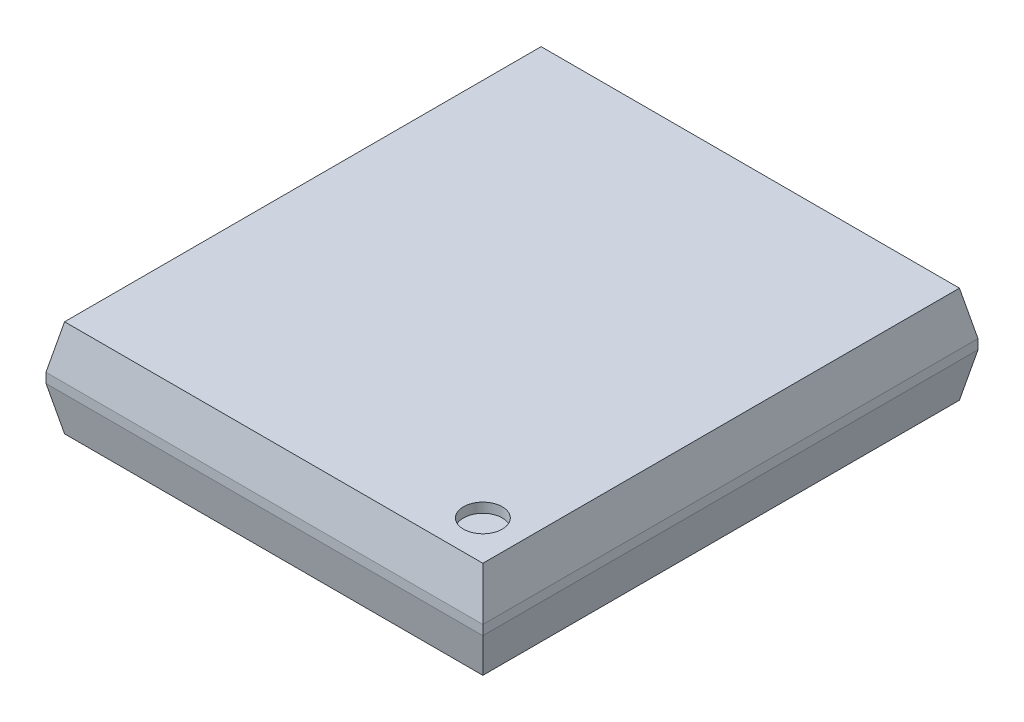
ISO-10303-21;
HEADER;
FILE_DESCRIPTION(('STEP AP214'),'2;1');
FILE_NAME('part.step','',(''),(''),'','','');
FILE_SCHEMA(('AUTOMOTIVE_DESIGN { 1 0 10303 214 1 1 1 1 }'));
ENDSEC;
DATA;
#1=APPLICATION_CONTEXT('core data for automotive mechanical design processes');
#2=APPLICATION_PROTOCOL_DEFINITION('international standard','automotive_design',2000,#1);
#3=PRODUCT_CONTEXT('',#1,'mechanical');
#4=PRODUCT('Part','Part','',(#3));
#5=PRODUCT_RELATED_PRODUCT_CATEGORY('part','',(#4));
#6=PRODUCT_DEFINITION_FORMATION('','',#4);
#7=PRODUCT_DEFINITION_CONTEXT('part definition',#1,'design');
#8=PRODUCT_DEFINITION('design','',#6,#7);
#9=PRODUCT_DEFINITION_SHAPE('','',#8);
#10=(LENGTH_UNIT() NAMED_UNIT(*) SI_UNIT(.MILLI.,.METRE.));
#11=(NAMED_UNIT(*) PLANE_ANGLE_UNIT() SI_UNIT($,.RADIAN.));
#12=(NAMED_UNIT(*) SI_UNIT($,.STERADIAN.) SOLID_ANGLE_UNIT());
#13=UNCERTAINTY_MEASURE_WITH_UNIT(LENGTH_MEASURE(1.E-05),#10,'distance_accuracy_value','');
#14=(GEOMETRIC_REPRESENTATION_CONTEXT(3) GLOBAL_UNCERTAINTY_ASSIGNED_CONTEXT((#13)) GLOBAL_UNIT_ASSIGNED_CONTEXT((#10,
#11,#12)) REPRESENTATION_CONTEXT('',''));
#15=CARTESIAN_POINT('',(0.,0.,0.));
#16=DIRECTION('',(0.,0.,1.));
#17=DIRECTION('',(1.,0.,0.));
#18=AXIS2_PLACEMENT_3D('',#15,#16,#17);
#19=CARTESIAN_POINT('',(1.75,0.4,2.05));
#20=DIRECTION('',(0.,1.,0.));
#21=DIRECTION('',(0.,0.,1.));
#22=AXIS2_PLACEMENT_3D('',#19,#20,#21);
#23=PLANE('',#22);
#24=CARTESIAN_POINT('',(1.75,0.4,2.05));
#25=DIRECTION('',(0.,1.,0.));
#26=DIRECTION('',(0.,0.,1.));
#27=AXIS2_PLACEMENT_3D('',#24,#25,#26);
#28=CIRCLE('',#27,0.200000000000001);
#29=CARTESIAN_POINT('',(1.75,0.4,2.25));
#30=VERTEX_POINT('',#29);
#31=EDGE_CURVE('E20',#30,#30,#28,.T.);
#32=ORIENTED_EDGE('',*,*,#31,.T.);
#33=EDGE_LOOP('',(#32));
#34=FACE_BOUND('',#33,.T.);
#35=ADVANCED_FACE('F17',(#34),#23,.T.);
#36=CARTESIAN_POINT('',(1.75,0.4,2.05));
#37=DIRECTION('',(0.,1.,0.));
#38=DIRECTION('',(0.,0.,1.));
#39=AXIS2_PLACEMENT_3D('',#36,#37,#38);
#40=CYLINDRICAL_SURFACE('',#39,0.200000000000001);
#41=CARTESIAN_POINT('',(1.75,0.5,2.05));
#42=DIRECTION('',(0.,1.,0.));
#43=DIRECTION('',(0.,0.,1.));
#44=AXIS2_PLACEMENT_3D('',#41,#42,#43);
#45=CIRCLE('',#44,0.200000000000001);
#46=CARTESIAN_POINT('',(1.75,0.5,2.25));
#47=VERTEX_POINT('',#46);
#48=EDGE_CURVE('E96',#47,#47,#45,.F.);
#49=ORIENTED_EDGE('',*,*,#48,.F.);
#50=EDGE_LOOP('',(#49));
#51=FACE_BOUND('',#50,.T.);
#52=ORIENTED_EDGE('',*,*,#31,.F.);
#53=EDGE_LOOP('',(#52));
#54=FACE_BOUND('',#53,.T.);
#55=ADVANCED_FACE('F115',(#51,#54),#40,.F.);
#56=CARTESIAN_POINT('',(-2.25,0.5,2.55));
#57=DIRECTION('',(0.,1.,0.));
#58=DIRECTION('',(0.,0.,1.));
#59=AXIS2_PLACEMENT_3D('',#56,#57,#58);
#60=PLANE('',#59);
#61=DIRECTION('',(1.,0.,0.));
#62=VECTOR('',#61,1.);
#63=CARTESIAN_POINT('',(-2.25,0.5,2.45434954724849));
#64=LINE('',#63,#62);
#65=CARTESIAN_POINT('',(-2.15434954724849,0.5,2.45434954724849));
#66=VERTEX_POINT('',#65);
#67=CARTESIAN_POINT('',(2.15434954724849,0.5,2.45434954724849));
#68=VERTEX_POINT('',#67);
#69=EDGE_CURVE('E88',#66,#68,#64,.T.);
#70=ORIENTED_EDGE('',*,*,#69,.T.);
#71=DIRECTION('',(0.,0.,1.));
#72=VECTOR('',#71,1.);
#73=CARTESIAN_POINT('',(2.15434954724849,0.5,2.55));
#74=LINE('',#73,#72);
#75=CARTESIAN_POINT('',(2.15434954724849,0.5,-2.45434954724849));
#76=VERTEX_POINT('',#75);
#77=EDGE_CURVE('E79',#68,#76,#74,.F.);
#78=ORIENTED_EDGE('',*,*,#77,.T.);
#79=DIRECTION('',(1.,0.,0.));
#80=VECTOR('',#79,1.);
#81=CARTESIAN_POINT('',(-2.25,0.5,-2.45434954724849));
#82=LINE('',#81,#80);
#83=CARTESIAN_POINT('',(-2.15434954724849,0.5,-2.45434954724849));
#84=VERTEX_POINT('',#83);
#85=EDGE_CURVE('E90',#76,#84,#82,.F.);
#86=ORIENTED_EDGE('',*,*,#85,.T.);
#87=DIRECTION('',(0.,0.,1.));
#88=VECTOR('',#87,1.);
#89=CARTESIAN_POINT('',(-2.15434954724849,0.5,2.55));
#90=LINE('',#89,#88);
#91=EDGE_CURVE('E84',#84,#66,#90,.T.);
#92=ORIENTED_EDGE('',*,*,#91,.T.);
#93=EDGE_LOOP('',(#70,#78,#86,#92));
#94=FACE_BOUND('',#93,.T.);
#95=ORIENTED_EDGE('',*,*,#48,.T.);
#96=EDGE_LOOP('',(#95));
#97=FACE_BOUND('',#96,.T.);
#98=ADVANCED_FACE('F86',(#94,#97),#60,.T.);
#99=CARTESIAN_POINT('',(-2.15434954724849,0.5,2.55));
#100=DIRECTION('',(0.978147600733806,-0.207911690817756,0.));
#101=DIRECTION('',(0.207911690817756,0.978147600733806,0.));
#102=AXIS2_PLACEMENT_3D('',#99,#100,#101);
#103=PLANE('',#102);
#104=DIRECTION('',(0.,0.,1.));
#105=VECTOR('',#104,1.);
#106=CARTESIAN_POINT('',(-2.25,0.0499999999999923,-2.55));
#107=LINE('',#106,#105);
#108=CARTESIAN_POINT('',(-2.25,0.0499999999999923,2.55));
#109=VERTEX_POINT('',#108);
#110=CARTESIAN_POINT('',(-2.25,0.0499999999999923,-2.55));
#111=VERTEX_POINT('',#110);
#112=EDGE_CURVE('E105',#109,#111,#107,.F.);
#113=ORIENTED_EDGE('',*,*,#112,.F.);
#114=DIRECTION('',(0.203558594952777,0.957667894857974,-0.203558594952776));
#115=VECTOR('',#114,1.);
#116=CARTESIAN_POINT('',(-2.25,0.0499999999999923,2.55));
#117=LINE('',#116,#115);
#118=EDGE_CURVE('E95',#109,#66,#117,.T.);
#119=ORIENTED_EDGE('',*,*,#118,.T.);
#120=ORIENTED_EDGE('',*,*,#91,.F.);
#121=DIRECTION('',(-0.203558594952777,-0.957667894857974,-0.203558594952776));
#122=VECTOR('',#121,1.);
#123=CARTESIAN_POINT('',(-2.15434954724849,0.5,-2.45434954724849));
#124=LINE('',#123,#122);
#125=EDGE_CURVE('E340',#84,#111,#124,.T.);
#126=ORIENTED_EDGE('',*,*,#125,.T.);
#127=EDGE_LOOP('',(#113,#119,#120,#126));
#128=FACE_BOUND('',#127,.T.);
#129=ADVANCED_FACE('F104',(#128),#103,.F.);
#130=CARTESIAN_POINT('',(-2.25,0.5,2.45434954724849));
#131=DIRECTION('',(0.,-0.207911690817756,-0.978147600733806));
#132=DIRECTION('',(0.,0.978147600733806,-0.207911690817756));
#133=AXIS2_PLACEMENT_3D('',#130,#131,#132);
#134=PLANE('',#133);
#135=ORIENTED_EDGE('',*,*,#69,.F.);
#136=ORIENTED_EDGE('',*,*,#118,.F.);
#137=DIRECTION('',(1.,0.,0.));
#138=VECTOR('',#137,1.);
#139=CARTESIAN_POINT('',(-2.25,0.0499999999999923,2.55));
#140=LINE('',#139,#138);
#141=CARTESIAN_POINT('',(2.25,0.0499999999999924,2.55));
#142=VERTEX_POINT('',#141);
#143=EDGE_CURVE('E334',#142,#109,#140,.F.);
#144=ORIENTED_EDGE('',*,*,#143,.F.);
#145=DIRECTION('',(-0.203558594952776,0.957667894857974,-0.203558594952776));
#146=VECTOR('',#145,1.);
#147=CARTESIAN_POINT('',(2.25,0.0499999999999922,2.55));
#148=LINE('',#147,#146);
#149=EDGE_CURVE('E102',#142,#68,#148,.T.);
#150=ORIENTED_EDGE('',*,*,#149,.T.);
#151=EDGE_LOOP('',(#135,#136,#144,#150));
#152=FACE_BOUND('',#151,.T.);
#153=ADVANCED_FACE('F99',(#152),#134,.F.);
#154=CARTESIAN_POINT('',(2.15434954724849,0.5,2.55));
#155=DIRECTION('',(-0.978147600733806,-0.207911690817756,0.));
#156=DIRECTION('',(0.207911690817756,-0.978147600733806,0.));
#157=AXIS2_PLACEMENT_3D('',#154,#155,#156);
#158=PLANE('',#157);
#159=DIRECTION('',(0.,0.,-1.));
#160=VECTOR('',#159,1.);
#161=CARTESIAN_POINT('',(2.25,0.0499999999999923,-2.55));
#162=LINE('',#161,#160);
#163=CARTESIAN_POINT('',(2.25,0.0499999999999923,-2.55));
#164=VERTEX_POINT('',#163);
#165=EDGE_CURVE('E311',#164,#142,#162,.F.);
#166=ORIENTED_EDGE('',*,*,#165,.F.);
#167=DIRECTION('',(-0.203558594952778,0.957667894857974,0.203558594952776));
#168=VECTOR('',#167,1.);
#169=CARTESIAN_POINT('',(2.25,0.0499999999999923,-2.55));
#170=LINE('',#169,#168);
#171=EDGE_CURVE('E313',#164,#76,#170,.T.);
#172=ORIENTED_EDGE('',*,*,#171,.T.);
#173=ORIENTED_EDGE('',*,*,#77,.F.);
#174=ORIENTED_EDGE('',*,*,#149,.F.);
#175=EDGE_LOOP('',(#166,#172,#173,#174));
#176=FACE_BOUND('',#175,.T.);
#177=ADVANCED_FACE('F166',(#176),#158,.F.);
#178=CARTESIAN_POINT('',(-2.25,0.5,-2.45434954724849));
#179=DIRECTION('',(0.,-0.207911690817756,0.978147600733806));
#180=DIRECTION('',(0.,-0.978147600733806,-0.207911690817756));
#181=AXIS2_PLACEMENT_3D('',#178,#179,#180);
#182=PLANE('',#181);
#183=DIRECTION('',(-1.,0.,0.));
#184=VECTOR('',#183,1.);
#185=CARTESIAN_POINT('',(-2.25,0.0499999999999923,-2.55));
#186=LINE('',#185,#184);
#187=EDGE_CURVE('E321',#111,#164,#186,.F.);
#188=ORIENTED_EDGE('',*,*,#187,.F.);
#189=ORIENTED_EDGE('',*,*,#125,.F.);
#190=ORIENTED_EDGE('',*,*,#85,.F.);
#191=ORIENTED_EDGE('',*,*,#171,.F.);
#192=EDGE_LOOP('',(#188,#189,#190,#191));
#193=FACE_BOUND('',#192,.T.);
#194=ADVANCED_FACE('F162',(#193),#182,.F.);
#195=CARTESIAN_POINT('',(-2.25,-0.5,-2.55));
#196=DIRECTION('',(-1.,0.,0.));
#197=DIRECTION('',(0.,0.,1.));
#198=AXIS2_PLACEMENT_3D('',#195,#196,#197);
#199=PLANE('',#198);
#200=DIRECTION('',(0.,1.,0.));
#201=VECTOR('',#200,1.);
#202=CARTESIAN_POINT('',(-2.25,-0.5,2.55));
#203=LINE('',#202,#201);
#204=CARTESIAN_POINT('',(-2.25,-0.0499999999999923,2.55));
#205=VERTEX_POINT('',#204);
#206=EDGE_CURVE('E336',#109,#205,#203,.F.);
#207=ORIENTED_EDGE('',*,*,#206,.F.);
#208=ORIENTED_EDGE('',*,*,#112,.T.);
#209=DIRECTION('',(0.,1.,0.));
#210=VECTOR('',#209,1.);
#211=CARTESIAN_POINT('',(-2.25,-0.5,-2.55));
#212=LINE('',#211,#210);
#213=CARTESIAN_POINT('',(-2.25,-0.0499999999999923,-2.55));
#214=VERTEX_POINT('',#213);
#215=EDGE_CURVE('E324',#214,#111,#212,.T.);
#216=ORIENTED_EDGE('',*,*,#215,.F.);
#217=DIRECTION('',(0.,0.,1.));
#218=VECTOR('',#217,1.);
#219=CARTESIAN_POINT('',(-2.25,-0.0499999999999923,-2.55));
#220=LINE('',#219,#218);
#221=EDGE_CURVE('E325',#205,#214,#220,.F.);
#222=ORIENTED_EDGE('',*,*,#221,.F.);
#223=EDGE_LOOP('',(#207,#208,#216,#222));
#224=FACE_BOUND('',#223,.T.);
#225=ADVANCED_FACE('F158',(#224),#199,.T.);
#226=CARTESIAN_POINT('',(-2.25,-0.5,2.55));
#227=DIRECTION('',(0.,0.,1.));
#228=DIRECTION('',(1.,0.,0.));
#229=AXIS2_PLACEMENT_3D('',#226,#227,#228);
#230=PLANE('',#229);
#231=DIRECTION('',(0.,1.,0.));
#232=VECTOR('',#231,1.);
#233=CARTESIAN_POINT('',(2.25,-0.5,2.55));
#234=LINE('',#233,#232);
#235=CARTESIAN_POINT('',(2.25,-0.0499999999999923,2.55));
#236=VERTEX_POINT('',#235);
#237=EDGE_CURVE('E317',#142,#236,#234,.F.);
#238=ORIENTED_EDGE('',*,*,#237,.F.);
#239=ORIENTED_EDGE('',*,*,#143,.T.);
#240=ORIENTED_EDGE('',*,*,#206,.T.);
#241=DIRECTION('',(1.,0.,0.));
#242=VECTOR('',#241,1.);
#243=CARTESIAN_POINT('',(-2.25,-0.0499999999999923,2.55));
#244=LINE('',#243,#242);
#245=EDGE_CURVE('E347',#236,#205,#244,.F.);
#246=ORIENTED_EDGE('',*,*,#245,.F.);
#247=EDGE_LOOP('',(#238,#239,#240,#246));
#248=FACE_BOUND('',#247,.T.);
#249=ADVANCED_FACE('F154',(#248),#230,.T.);
#250=CARTESIAN_POINT('',(2.25,-0.5,-2.55));
#251=DIRECTION('',(1.,0.,0.));
#252=DIRECTION('',(0.,0.,-1.));
#253=AXIS2_PLACEMENT_3D('',#250,#251,#252);
#254=PLANE('',#253);
#255=DIRECTION('',(0.,1.,0.));
#256=VECTOR('',#255,1.);
#257=CARTESIAN_POINT('',(2.25,-0.5,-2.55));
#258=LINE('',#257,#256);
#259=CARTESIAN_POINT('',(2.25,-0.0499999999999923,-2.55));
#260=VERTEX_POINT('',#259);
#261=EDGE_CURVE('E316',#164,#260,#258,.F.);
#262=ORIENTED_EDGE('',*,*,#261,.F.);
#263=ORIENTED_EDGE('',*,*,#165,.T.);
#264=ORIENTED_EDGE('',*,*,#237,.T.);
#265=DIRECTION('',(0.,0.,1.));
#266=VECTOR('',#265,1.);
#267=CARTESIAN_POINT('',(2.25,-0.0499999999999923,-2.55));
#268=LINE('',#267,#266);
#269=EDGE_CURVE('E329',#260,#236,#268,.T.);
#270=ORIENTED_EDGE('',*,*,#269,.F.);
#271=EDGE_LOOP('',(#262,#263,#264,#270));
#272=FACE_BOUND('',#271,.T.);
#273=ADVANCED_FACE('F150',(#272),#254,.T.);
#274=CARTESIAN_POINT('',(-2.25,-0.5,-2.55));
#275=DIRECTION('',(0.,0.,-1.));
#276=DIRECTION('',(-1.,0.,0.));
#277=AXIS2_PLACEMENT_3D('',#274,#275,#276);
#278=PLANE('',#277);
#279=ORIENTED_EDGE('',*,*,#215,.T.);
#280=ORIENTED_EDGE('',*,*,#187,.T.);
#281=ORIENTED_EDGE('',*,*,#261,.T.);
#282=DIRECTION('',(1.,0.,0.));
#283=VECTOR('',#282,1.);
#284=CARTESIAN_POINT('',(-2.25,-0.0499999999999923,-2.55));
#285=LINE('',#284,#283);
#286=EDGE_CURVE('E366',#214,#260,#285,.T.);
#287=ORIENTED_EDGE('',*,*,#286,.F.);
#288=EDGE_LOOP('',(#279,#280,#281,#287));
#289=FACE_BOUND('',#288,.T.);
#290=ADVANCED_FACE('F146',(#289),#278,.T.);
#291=CARTESIAN_POINT('',(-2.25,-0.0499999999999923,-2.55));
#292=DIRECTION('',(-0.978147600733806,-0.207911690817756,0.));
#293=DIRECTION('',(0.207911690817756,-0.978147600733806,0.));
#294=AXIS2_PLACEMENT_3D('',#291,#292,#293);
#295=PLANE('',#294);
#296=DIRECTION('',(0.203558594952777,-0.957667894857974,-0.203558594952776));
#297=VECTOR('',#296,1.);
#298=CARTESIAN_POINT('',(-2.25,-0.0499999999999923,2.55));
#299=LINE('',#298,#297);
#300=CARTESIAN_POINT('',(-2.15434954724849,-0.5,2.45434954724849));
#301=VERTEX_POINT('',#300);
#302=EDGE_CURVE('E351',#205,#301,#299,.T.);
#303=ORIENTED_EDGE('',*,*,#302,.F.);
#304=ORIENTED_EDGE('',*,*,#221,.T.);
#305=DIRECTION('',(-0.203558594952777,0.957667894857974,-0.203558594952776));
#306=VECTOR('',#305,1.);
#307=CARTESIAN_POINT('',(-2.15434954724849,-0.5,-2.45434954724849));
#308=LINE('',#307,#306);
#309=CARTESIAN_POINT('',(-2.15434954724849,-0.5,-2.45434954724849));
#310=VERTEX_POINT('',#309);
#311=EDGE_CURVE('E354',#310,#214,#308,.T.);
#312=ORIENTED_EDGE('',*,*,#311,.F.);
#313=DIRECTION('',(0.,0.,1.));
#314=VECTOR('',#313,1.);
#315=CARTESIAN_POINT('',(-2.15434954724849,-0.5,2.55));
#316=LINE('',#315,#314);
#317=EDGE_CURVE('E370',#310,#301,#316,.T.);
#318=ORIENTED_EDGE('',*,*,#317,.T.);
#319=EDGE_LOOP('',(#303,#304,#312,#318));
#320=FACE_BOUND('',#319,.T.);
#321=ADVANCED_FACE('F142',(#320),#295,.T.);
#322=CARTESIAN_POINT('',(-2.25,-0.0499999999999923,2.55));
#323=DIRECTION('',(0.,-0.207911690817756,0.978147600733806));
#324=DIRECTION('',(0.,-0.978147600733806,-0.207911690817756));
#325=AXIS2_PLACEMENT_3D('',#322,#323,#324);
#326=PLANE('',#325);
#327=DIRECTION('',(-0.203558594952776,-0.957667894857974,-0.203558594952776));
#328=VECTOR('',#327,1.);
#329=CARTESIAN_POINT('',(2.25,-0.0499999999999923,2.55));
#330=LINE('',#329,#328);
#331=CARTESIAN_POINT('',(2.15434954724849,-0.5,2.45434954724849));
#332=VERTEX_POINT('',#331);
#333=EDGE_CURVE('E350',#236,#332,#330,.T.);
#334=ORIENTED_EDGE('',*,*,#333,.F.);
#335=ORIENTED_EDGE('',*,*,#245,.T.);
#336=ORIENTED_EDGE('',*,*,#302,.T.);
#337=DIRECTION('',(1.,0.,0.));
#338=VECTOR('',#337,1.);
#339=CARTESIAN_POINT('',(-2.25,-0.5,2.45434954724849));
#340=LINE('',#339,#338);
#341=EDGE_CURVE('E358',#301,#332,#340,.T.);
#342=ORIENTED_EDGE('',*,*,#341,.T.);
#343=EDGE_LOOP('',(#334,#335,#336,#342));
#344=FACE_BOUND('',#343,.T.);
#345=ADVANCED_FACE('F138',(#344),#326,.T.);
#346=CARTESIAN_POINT('',(2.25,-0.0499999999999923,-2.55));
#347=DIRECTION('',(0.978147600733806,-0.207911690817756,0.));
#348=DIRECTION('',(0.207911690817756,0.978147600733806,0.));
#349=AXIS2_PLACEMENT_3D('',#346,#347,#348);
#350=PLANE('',#349);
#351=DIRECTION('',(-0.203558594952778,-0.957667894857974,0.203558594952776));
#352=VECTOR('',#351,1.);
#353=CARTESIAN_POINT('',(2.25,-0.0499999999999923,-2.55));
#354=LINE('',#353,#352);
#355=CARTESIAN_POINT('',(2.15434954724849,-0.5,-2.45434954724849));
#356=VERTEX_POINT('',#355);
#357=EDGE_CURVE('E34',#260,#356,#354,.T.);
#358=ORIENTED_EDGE('',*,*,#357,.F.);
#359=ORIENTED_EDGE('',*,*,#269,.T.);
#360=ORIENTED_EDGE('',*,*,#333,.T.);
#361=DIRECTION('',(0.,0.,1.));
#362=VECTOR('',#361,1.);
#363=CARTESIAN_POINT('',(2.15434954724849,-0.5,2.55));
#364=LINE('',#363,#362);
#365=EDGE_CURVE('E26',#332,#356,#364,.F.);
#366=ORIENTED_EDGE('',*,*,#365,.T.);
#367=EDGE_LOOP('',(#358,#359,#360,#366));
#368=FACE_BOUND('',#367,.T.);
#369=ADVANCED_FACE('F132',(#368),#350,.T.);
#370=CARTESIAN_POINT('',(-2.25,-0.0499999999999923,-2.55));
#371=DIRECTION('',(0.,-0.207911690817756,-0.978147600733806));
#372=DIRECTION('',(0.,0.978147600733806,-0.207911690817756));
#373=AXIS2_PLACEMENT_3D('',#370,#371,#372);
#374=PLANE('',#373);
#375=ORIENTED_EDGE('',*,*,#357,.T.);
#376=DIRECTION('',(1.,0.,0.));
#377=VECTOR('',#376,1.);
#378=CARTESIAN_POINT('',(-2.25,-0.5,-2.45434954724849));
#379=LINE('',#378,#377);
#380=EDGE_CURVE('E10',#356,#310,#379,.F.);
#381=ORIENTED_EDGE('',*,*,#380,.T.);
#382=ORIENTED_EDGE('',*,*,#311,.T.);
#383=ORIENTED_EDGE('',*,*,#286,.T.);
#384=EDGE_LOOP('',(#375,#381,#382,#383));
#385=FACE_BOUND('',#384,.T.);
#386=ADVANCED_FACE('F126',(#385),#374,.T.);
#387=CARTESIAN_POINT('',(-2.25,-0.5,2.55));
#388=DIRECTION('',(0.,1.,0.));
#389=DIRECTION('',(0.,0.,1.));
#390=AXIS2_PLACEMENT_3D('',#387,#388,#389);
#391=PLANE('',#390);
#392=ORIENTED_EDGE('',*,*,#365,.F.);
#393=ORIENTED_EDGE('',*,*,#341,.F.);
#394=ORIENTED_EDGE('',*,*,#317,.F.);
#395=ORIENTED_EDGE('',*,*,#380,.F.);
#396=EDGE_LOOP('',(#392,#393,#394,#395));
#397=FACE_BOUND('',#396,.T.);
#398=ADVANCED_FACE('F124',(#397),#391,.F.);
#399=CLOSED_SHELL('',(#35,#55,#98,#129,#153,#177,#194,#225,#249,#273,#290,#321,#345,#369,#386,#398));
#400=MANIFOLD_SOLID_BREP('B1',#399);
#401=ADVANCED_BREP_SHAPE_REPRESENTATION('',(#18,#400),#14);
#402=SHAPE_DEFINITION_REPRESENTATION(#9,#401);
ENDSEC;
END-ISO-10303-21;
